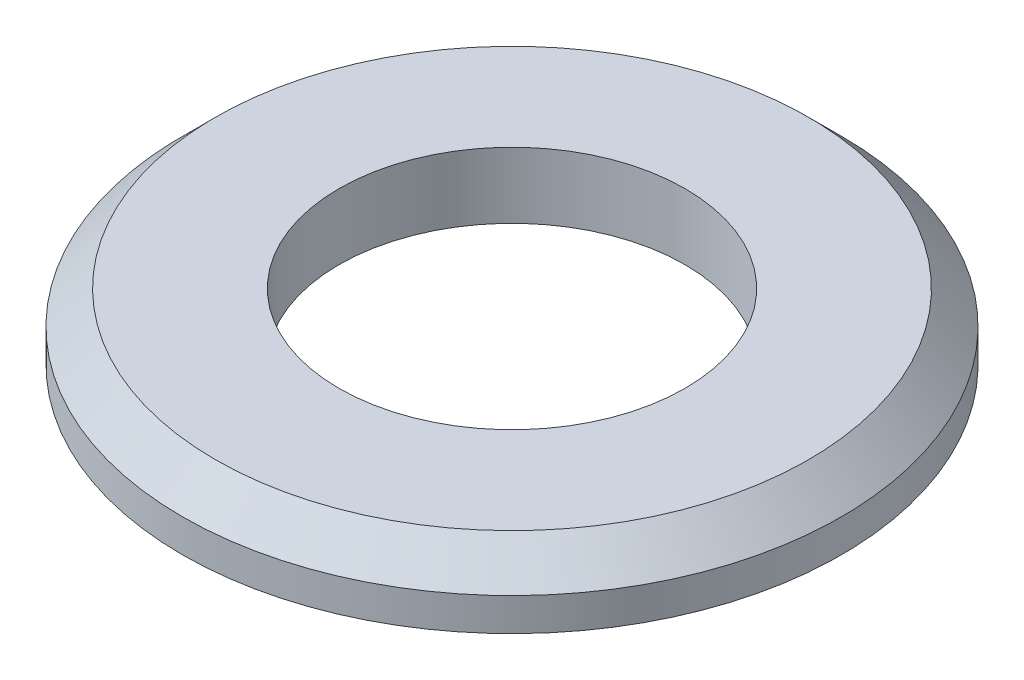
from build123d import *

# Parameters (mm, degrees)
SKETCH1_R      = 8
SKETCH1_R_2    = 4.2
EXTRUDE1_DEPTH = 1.6
CHAMFER1_SIZE  = 0.8


with BuildPart() as part:
    # Sketch1 → Extrude1 (new body)
    with BuildSketch(Plane(origin=(0, 0, 0), x_dir=(1, 0, 0), z_dir=(0, 1, 0))):
        with Locations(Location((0, 0, 0), (0, 0, 270))):
            Circle(SKETCH1_R)
        with Locations(Location((0, 0, 0), (0, 0, 270))):
            Circle(SKETCH1_R_2, mode=Mode.SUBTRACT)
    extrude(amount=EXTRUDE1_DEPTH)

    # Chamfer1
    chamfer1_edges = [part.edges().sort_by_distance(p)[0] for p in [
        (0, 1.6, -8),
    ]]
    chamfer(chamfer1_edges, length=CHAMFER1_SIZE)


solid = part.part
